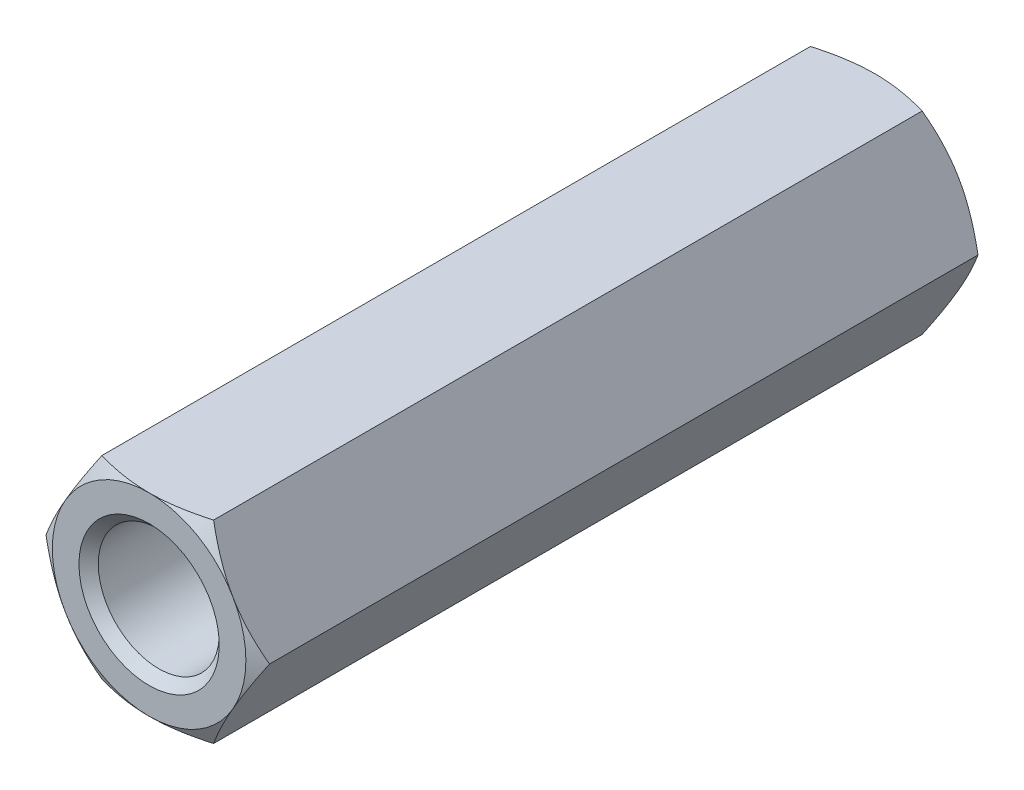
ISO-10303-21;
HEADER;
FILE_DESCRIPTION(('STEP AP214'),'2;1');
FILE_NAME('part.step','',(''),(''),'','','');
FILE_SCHEMA(('AUTOMOTIVE_DESIGN { 1 0 10303 214 1 1 1 1 }'));
ENDSEC;
DATA;
#1=APPLICATION_CONTEXT('core data for automotive mechanical design processes');
#2=APPLICATION_PROTOCOL_DEFINITION('international standard','automotive_design',2000,#1);
#3=PRODUCT_CONTEXT('',#1,'mechanical');
#4=PRODUCT('Part','Part','',(#3));
#5=PRODUCT_RELATED_PRODUCT_CATEGORY('part','',(#4));
#6=PRODUCT_DEFINITION_FORMATION('','',#4);
#7=PRODUCT_DEFINITION_CONTEXT('part definition',#1,'design');
#8=PRODUCT_DEFINITION('design','',#6,#7);
#9=PRODUCT_DEFINITION_SHAPE('','',#8);
#10=(LENGTH_UNIT() NAMED_UNIT(*) SI_UNIT(.MILLI.,.METRE.));
#11=(NAMED_UNIT(*) PLANE_ANGLE_UNIT() SI_UNIT($,.RADIAN.));
#12=(NAMED_UNIT(*) SI_UNIT($,.STERADIAN.) SOLID_ANGLE_UNIT());
#13=UNCERTAINTY_MEASURE_WITH_UNIT(LENGTH_MEASURE(1.E-05),#10,'distance_accuracy_value','');
#14=(GEOMETRIC_REPRESENTATION_CONTEXT(3) GLOBAL_UNCERTAINTY_ASSIGNED_CONTEXT((#13)) GLOBAL_UNIT_ASSIGNED_CONTEXT((#10,
#11,#12)) REPRESENTATION_CONTEXT('',''));
#15=CARTESIAN_POINT('',(0.,0.,0.));
#16=DIRECTION('',(0.,0.,1.));
#17=DIRECTION('',(1.,0.,0.));
#18=AXIS2_PLACEMENT_3D('',#15,#16,#17);
#19=CARTESIAN_POINT('',(4.61880215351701,0.,-15.));
#20=DIRECTION('',(0.866025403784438,0.5,0.));
#21=DIRECTION('',(-0.5,0.866025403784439,0.));
#22=AXIS2_PLACEMENT_3D('',#19,#20,#21);
#23=PLANE('',#22);
#24=CARTESIAN_POINT('',(4.61891762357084,-0.000199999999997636,14.6426677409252));
#25=CARTESIAN_POINT('',(4.5174314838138,0.17557915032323,14.7012821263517));
#26=CARTESIAN_POINT('',(4.41506932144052,0.352875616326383,14.7545896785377));
#27=CARTESIAN_POINT('',(4.20857250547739,0.710538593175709,14.8476383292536));
#28=CARTESIAN_POINT('',(4.10443418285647,0.890911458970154,14.8873465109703));
#29=CARTESIAN_POINT('',(3.89744813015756,1.24942181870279,14.9491577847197));
#30=CARTESIAN_POINT('',(3.79463224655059,1.42750415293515,14.9716722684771));
#31=CARTESIAN_POINT('',(3.58851671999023,1.78450671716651,14.9985493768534));
#32=CARTESIAN_POINT('',(3.48521782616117,1.9634256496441,15.0029342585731));
#33=CARTESIAN_POINT('',(3.29219970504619,2.29774284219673,14.99380992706));
#34=CARTESIAN_POINT('',(3.20245157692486,2.45319115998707,14.982541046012));
#35=CARTESIAN_POINT('',(3.02354002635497,2.76307505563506,14.9468260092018));
#36=CARTESIAN_POINT('',(2.93437722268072,2.91750956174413,14.9223676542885));
#37=CARTESIAN_POINT('',(2.75509682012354,3.22803232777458,14.8612239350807));
#38=CARTESIAN_POINT('',(2.6650019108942,3.3840812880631,14.8242793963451));
#39=CARTESIAN_POINT('',(2.48615580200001,3.69385183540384,14.740429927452));
#40=CARTESIAN_POINT('',(2.39740231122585,3.84757739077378,14.6935446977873));
#41=CARTESIAN_POINT('',(2.30928560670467,4.0002,14.6426677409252));
#42=B_SPLINE_CURVE_WITH_KNOTS('',3,(#24,#25,#26,#27,#28,#29,#30,#31,#32,#33,#34,#35,#36,#37,#38,
#39,#40,#41),.UNSPECIFIED.,.F.,.F.,(4,2,2,2,2,2,2,2,4),(0.,0.634047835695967,1.26961969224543,
1.88946157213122,2.50854226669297,3.04757825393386,3.58711366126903,4.13861653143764,
4.68903648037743),.UNSPECIFIED.);
#43=CARTESIAN_POINT('',(4.61880215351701,0.,14.6427344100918));
#44=VERTEX_POINT('',#43);
#45=CARTESIAN_POINT('',(3.46410161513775,2.,15.));
#46=VERTEX_POINT('',#45);
#47=EDGE_CURVE('E171',#44,#46,#42,.T.);
#48=ORIENTED_EDGE('',*,*,#47,.F.);
#49=DIRECTION('',(0.,0.,1.));
#50=VECTOR('',#49,1.);
#51=CARTESIAN_POINT('',(4.61880215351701,0.,-15.));
#52=LINE('',#51,#50);
#53=CARTESIAN_POINT('',(4.61880215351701,0.,-14.6427344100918));
#54=VERTEX_POINT('',#53);
#55=EDGE_CURVE('E320',#54,#44,#52,.T.);
#56=ORIENTED_EDGE('',*,*,#55,.F.);
#57=CARTESIAN_POINT('',(4.61891762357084,-0.000199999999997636,-14.6426677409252));
#58=CARTESIAN_POINT('',(4.5174314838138,0.17557915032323,-14.7012821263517));
#59=CARTESIAN_POINT('',(4.41506932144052,0.352875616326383,-14.7545896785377));
#60=CARTESIAN_POINT('',(4.20857250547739,0.710538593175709,-14.8476383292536));
#61=CARTESIAN_POINT('',(4.10443418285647,0.890911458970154,-14.8873465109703));
#62=CARTESIAN_POINT('',(3.89744813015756,1.24942181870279,-14.9491577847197));
#63=CARTESIAN_POINT('',(3.79463224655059,1.42750415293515,-14.9716722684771));
#64=CARTESIAN_POINT('',(3.58851671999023,1.78450671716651,-14.9985493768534));
#65=CARTESIAN_POINT('',(3.48521782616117,1.9634256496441,-15.0029342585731));
#66=CARTESIAN_POINT('',(3.29219970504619,2.29774284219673,-14.99380992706));
#67=CARTESIAN_POINT('',(3.20245157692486,2.45319115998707,-14.982541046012));
#68=CARTESIAN_POINT('',(3.02354002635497,2.76307505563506,-14.9468260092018));
#69=CARTESIAN_POINT('',(2.93437722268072,2.91750956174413,-14.9223676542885));
#70=CARTESIAN_POINT('',(2.75509682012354,3.22803232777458,-14.8612239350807));
#71=CARTESIAN_POINT('',(2.6650019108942,3.3840812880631,-14.8242793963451));
#72=CARTESIAN_POINT('',(2.48615580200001,3.69385183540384,-14.740429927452));
#73=CARTESIAN_POINT('',(2.39740231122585,3.84757739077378,-14.6935446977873));
#74=CARTESIAN_POINT('',(2.30928560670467,4.0002,-14.6426677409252));
#75=B_SPLINE_CURVE_WITH_KNOTS('',3,(#57,#58,#59,#60,#61,#62,#63,#64,#65,#66,#67,#68,#69,#70,#71,
#72,#73,#74),.UNSPECIFIED.,.F.,.F.,(4,2,2,2,2,2,2,2,4),(0.,0.634047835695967,1.26961969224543,
1.88946157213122,2.50854226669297,3.04757825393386,3.58711366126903,4.13861653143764,
4.68903648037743),.UNSPECIFIED.);
#76=CARTESIAN_POINT('',(3.46410161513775,2.,-15.));
#77=VERTEX_POINT('',#76);
#78=EDGE_CURVE('E305',#54,#77,#75,.T.);
#79=ORIENTED_EDGE('',*,*,#78,.T.);
#80=CARTESIAN_POINT('',(2.30940107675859,4.,-14.6427344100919));
#81=VERTEX_POINT('',#80);
#82=EDGE_CURVE('E252',#77,#81,#75,.T.);
#83=ORIENTED_EDGE('',*,*,#82,.T.);
#84=DIRECTION('',(0.,0.,1.));
#85=VECTOR('',#84,1.);
#86=CARTESIAN_POINT('',(2.3094010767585,4.,-15.));
#87=LINE('',#86,#85);
#88=CARTESIAN_POINT('',(2.30940107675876,4.,14.642734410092));
#89=VERTEX_POINT('',#88);
#90=EDGE_CURVE('E353',#81,#89,#87,.T.);
#91=ORIENTED_EDGE('',*,*,#90,.T.);
#92=EDGE_CURVE('E147',#46,#89,#42,.T.);
#93=ORIENTED_EDGE('',*,*,#92,.F.);
#94=EDGE_LOOP('',(#48,#56,#79,#83,#91,#93));
#95=FACE_BOUND('',#94,.T.);
#96=ADVANCED_FACE('F41',(#95),#23,.T.);
#97=CARTESIAN_POINT('',(2.3094010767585,-4.,-15.));
#98=DIRECTION('',(0.866025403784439,-0.5,0.));
#99=DIRECTION('',(0.5,0.866025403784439,0.));
#100=AXIS2_PLACEMENT_3D('',#97,#98,#99);
#101=PLANE('',#100);
#102=CARTESIAN_POINT('',(2.30928560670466,-4.0002,14.6426677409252));
#103=CARTESIAN_POINT('',(2.4107717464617,-3.82442084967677,14.7012821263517));
#104=CARTESIAN_POINT('',(2.51313390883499,-3.64712438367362,14.7545896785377));
#105=CARTESIAN_POINT('',(2.71963072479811,-3.28946140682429,14.8476383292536));
#106=CARTESIAN_POINT('',(2.82376904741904,-3.10908854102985,14.8873465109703));
#107=CARTESIAN_POINT('',(3.03075510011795,-2.75057818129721,14.9491577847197));
#108=CARTESIAN_POINT('',(3.13357098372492,-2.57249584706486,14.9716722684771));
#109=CARTESIAN_POINT('',(3.33968651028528,-2.21549328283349,14.9985493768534));
#110=CARTESIAN_POINT('',(3.44298540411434,-2.0365743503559,15.0029342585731));
#111=CARTESIAN_POINT('',(3.63600352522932,-1.70225715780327,14.99380992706));
#112=CARTESIAN_POINT('',(3.72575165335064,-1.54680884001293,14.982541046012));
#113=CARTESIAN_POINT('',(3.90466320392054,-1.23692494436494,14.9468260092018));
#114=CARTESIAN_POINT('',(3.99382600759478,-1.08249043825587,14.9223676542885));
#115=CARTESIAN_POINT('',(4.17310641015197,-0.77196767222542,14.8612239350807));
#116=CARTESIAN_POINT('',(4.26320131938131,-0.615918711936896,14.8242793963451));
#117=CARTESIAN_POINT('',(4.4420474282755,-0.306148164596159,14.740429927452));
#118=CARTESIAN_POINT('',(4.53080091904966,-0.152422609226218,14.6935446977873));
#119=CARTESIAN_POINT('',(4.61891762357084,0.00020000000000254,14.6426677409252));
#120=B_SPLINE_CURVE_WITH_KNOTS('',3,(#102,#103,#104,#105,#106,#107,#108,#109,#110,#111,#112,
#113,#114,#115,#116,#117,#118,#119),.UNSPECIFIED.,.F.,.F.,(4,2,2,2,2,2,2,2,4),(0.,
0.634047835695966,1.26961969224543,1.88946157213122,2.50854226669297,3.04757825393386,
3.58711366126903,4.13861653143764,4.68903648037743),.UNSPECIFIED.);
#121=CARTESIAN_POINT('',(2.3094010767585,-4.,14.6427344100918));
#122=VERTEX_POINT('',#121);
#123=CARTESIAN_POINT('',(3.46410161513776,-2.,15.));
#124=VERTEX_POINT('',#123);
#125=EDGE_CURVE('E393',#122,#124,#120,.T.);
#126=ORIENTED_EDGE('',*,*,#125,.F.);
#127=DIRECTION('',(0.,0.,1.));
#128=VECTOR('',#127,1.);
#129=CARTESIAN_POINT('',(2.3094010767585,-4.,-15.));
#130=LINE('',#129,#128);
#131=CARTESIAN_POINT('',(2.3094010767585,-4.,-14.6427344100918));
#132=VERTEX_POINT('',#131);
#133=EDGE_CURVE('E406',#132,#122,#130,.T.);
#134=ORIENTED_EDGE('',*,*,#133,.F.);
#135=CARTESIAN_POINT('',(2.30928560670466,-4.0002,-14.6426677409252));
#136=CARTESIAN_POINT('',(2.4107717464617,-3.82442084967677,-14.7012821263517));
#137=CARTESIAN_POINT('',(2.51313390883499,-3.64712438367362,-14.7545896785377));
#138=CARTESIAN_POINT('',(2.71963072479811,-3.28946140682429,-14.8476383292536));
#139=CARTESIAN_POINT('',(2.82376904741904,-3.10908854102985,-14.8873465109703));
#140=CARTESIAN_POINT('',(3.03075510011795,-2.75057818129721,-14.9491577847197));
#141=CARTESIAN_POINT('',(3.13357098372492,-2.57249584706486,-14.9716722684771));
#142=CARTESIAN_POINT('',(3.33968651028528,-2.21549328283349,-14.9985493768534));
#143=CARTESIAN_POINT('',(3.44298540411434,-2.0365743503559,-15.0029342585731));
#144=CARTESIAN_POINT('',(3.63600352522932,-1.70225715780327,-14.99380992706));
#145=CARTESIAN_POINT('',(3.72575165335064,-1.54680884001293,-14.982541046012));
#146=CARTESIAN_POINT('',(3.90466320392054,-1.23692494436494,-14.9468260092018));
#147=CARTESIAN_POINT('',(3.99382600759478,-1.08249043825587,-14.9223676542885));
#148=CARTESIAN_POINT('',(4.17310641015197,-0.77196767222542,-14.8612239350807));
#149=CARTESIAN_POINT('',(4.26320131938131,-0.615918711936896,-14.8242793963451));
#150=CARTESIAN_POINT('',(4.4420474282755,-0.306148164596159,-14.740429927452));
#151=CARTESIAN_POINT('',(4.53080091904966,-0.152422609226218,-14.6935446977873));
#152=CARTESIAN_POINT('',(4.61891762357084,0.00020000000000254,-14.6426677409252));
#153=B_SPLINE_CURVE_WITH_KNOTS('',3,(#135,#136,#137,#138,#139,#140,#141,#142,#143,#144,#145,
#146,#147,#148,#149,#150,#151,#152),.UNSPECIFIED.,.F.,.F.,(4,2,2,2,2,2,2,2,4),(0.,
0.634047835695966,1.26961969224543,1.88946157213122,2.50854226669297,3.04757825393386,
3.58711366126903,4.13861653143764,4.68903648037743),.UNSPECIFIED.);
#154=CARTESIAN_POINT('',(3.46410161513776,-2.,-15.));
#155=VERTEX_POINT('',#154);
#156=EDGE_CURVE('E335',#132,#155,#153,.T.);
#157=ORIENTED_EDGE('',*,*,#156,.T.);
#158=EDGE_CURVE('E249',#155,#54,#153,.T.);
#159=ORIENTED_EDGE('',*,*,#158,.T.);
#160=ORIENTED_EDGE('',*,*,#55,.T.);
#161=EDGE_CURVE('E175',#124,#44,#120,.T.);
#162=ORIENTED_EDGE('',*,*,#161,.F.);
#163=EDGE_LOOP('',(#126,#134,#157,#159,#160,#162));
#164=FACE_BOUND('',#163,.T.);
#165=ADVANCED_FACE('F332',(#164),#101,.T.);
#166=CARTESIAN_POINT('',(-2.3094010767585,-4.,-15.));
#167=DIRECTION('',(0.,-1.,0.));
#168=DIRECTION('',(0.,0.,-1.));
#169=AXIS2_PLACEMENT_3D('',#166,#167,#168);
#170=PLANE('',#169);
#171=CARTESIAN_POINT('',(-24.529910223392,-4.,2.95999347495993));
#172=CARTESIAN_POINT('',(-24.0041569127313,-4.,3.2595744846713));
#173=CARTESIAN_POINT('',(-23.4783010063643,-4.,3.55897565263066));
#174=CARTESIAN_POINT('',(-22.4263269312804,-4.,4.1573181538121));
#175=CARTESIAN_POINT('',(-21.9002087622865,-4.,4.4562594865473));
#176=CARTESIAN_POINT('',(-20.847613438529,-4.,5.05360466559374));
#177=CARTESIAN_POINT('',(-20.3211362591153,-4.,5.35200846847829));
#178=CARTESIAN_POINT('',(-19.2677841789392,-4.,5.94811289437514));
#179=CARTESIAN_POINT('',(-18.7409092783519,-4.,6.2458135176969));
#180=CARTESIAN_POINT('',(-17.6880402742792,-4.,6.83953895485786));
#181=CARTESIAN_POINT('',(-17.1620474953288,-4.,7.13556611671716));
#182=CARTESIAN_POINT('',(-16.1094130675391,-4.,7.72646430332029));
#183=CARTESIAN_POINT('',(-15.5827714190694,-4.,8.02133532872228));
#184=CARTESIAN_POINT('',(-14.528656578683,-4.,8.60952553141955));
#185=CARTESIAN_POINT('',(-14.0011834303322,-4.,8.90284478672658));
#186=CARTESIAN_POINT('',(-12.9450711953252,-4.,9.48737519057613));
#187=CARTESIAN_POINT('',(-12.416432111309,-4.,9.77858634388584));
#188=CARTESIAN_POINT('',(-11.3530989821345,-4.,10.3604528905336));
#189=CARTESIAN_POINT('',(-10.8183912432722,-4.,10.6510833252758));
#190=CARTESIAN_POINT('',(-10.0144703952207,-4.,11.0836402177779));
#191=CARTESIAN_POINT('',(-9.74617315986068,-4.,11.2272683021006));
#192=CARTESIAN_POINT('',(-9.2088200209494,-4.,11.5130972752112));
#193=CARTESIAN_POINT('',(-8.93976412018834,-4.,11.6552981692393));
#194=CARTESIAN_POINT('',(-8.40003712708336,-4.,11.9382495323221));
#195=CARTESIAN_POINT('',(-8.12936368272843,-4.,12.0789955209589));
#196=CARTESIAN_POINT('',(-7.58681848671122,-4.,12.3581502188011));
#197=CARTESIAN_POINT('',(-7.31494675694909,-4.,12.4965589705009));
#198=CARTESIAN_POINT('',(-6.76970207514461,-4.,12.7702855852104));
#199=CARTESIAN_POINT('',(-6.49632937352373,-4.,12.9056039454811));
#200=CARTESIAN_POINT('',(-5.94757923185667,-4.,13.1721041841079));
#201=CARTESIAN_POINT('',(-5.67220184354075,-4.,13.3032861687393));
#202=CARTESIAN_POINT('',(-5.10777623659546,-4.,13.5650778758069));
#203=CARTESIAN_POINT('',(-4.81862005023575,-4.,13.6954571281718));
#204=CARTESIAN_POINT('',(-4.38201817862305,-4.,13.8843518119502));
#205=CARTESIAN_POINT('',(-4.23601546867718,-4.,13.9462006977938));
#206=CARTESIAN_POINT('',(-3.94289295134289,-4.,14.0671859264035));
#207=CARTESIAN_POINT('',(-3.79577318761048,-4.,14.1263223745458));
#208=CARTESIAN_POINT('',(-3.50054825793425,-4.,14.2411784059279));
#209=CARTESIAN_POINT('',(-3.35244573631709,-4.,14.2969047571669));
#210=CARTESIAN_POINT('',(-3.05479485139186,-4.,14.4043322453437));
#211=CARTESIAN_POINT('',(-2.90524660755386,-4.,14.4560337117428));
#212=CARTESIAN_POINT('',(-2.6045619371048,-4.,14.5545010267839));
#213=CARTESIAN_POINT('',(-2.45342593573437,-4.,14.6012681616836));
#214=CARTESIAN_POINT('',(-2.14944153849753,-4.,14.6887946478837));
#215=CARTESIAN_POINT('',(-1.99659333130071,-4.,14.7295546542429));
#216=CARTESIAN_POINT('',(-1.62479121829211,-4.,14.8193669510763));
#217=CARTESIAN_POINT('',(-1.40491524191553,-4.,14.864762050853));
#218=CARTESIAN_POINT('',(-1.07290957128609,-4.,14.9191532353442));
#219=CARTESIAN_POINT('',(-0.961882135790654,-4.,14.9349995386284));
#220=CARTESIAN_POINT('',(-0.73923703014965,-4.,14.9617336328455));
#221=CARTESIAN_POINT('',(-0.627619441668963,-4.,14.9726220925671));
#222=CARTESIAN_POINT('',(-0.404512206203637,-4.,14.9890960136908));
#223=CARTESIAN_POINT('',(-0.2930243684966,-4.,14.9947058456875));
#224=CARTESIAN_POINT('',(-0.0699080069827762,-4.,15.0005435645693));
#225=CARTESIAN_POINT('',(0.041720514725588,-4.,15.0007715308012));
#226=CARTESIAN_POINT('',(0.264868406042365,-4.,14.9958378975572));
#227=CARTESIAN_POINT('',(0.37638776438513,-4.,14.9906757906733));
#228=CARTESIAN_POINT('',(0.599062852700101,-4.,14.975116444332));
#229=CARTESIAN_POINT('',(0.710218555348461,-4.,14.9647188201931));
#230=CARTESIAN_POINT('',(0.973491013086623,-4.,14.93415287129));
#231=CARTESIAN_POINT('',(1.12535470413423,-4.,14.9117835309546));
#232=CARTESIAN_POINT('',(1.42761451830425,-4.,14.8587319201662));
#233=CARTESIAN_POINT('',(1.57801039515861,-4.,14.8280482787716));
#234=CARTESIAN_POINT('',(2.02698264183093,-4.,14.7252856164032));
#235=CARTESIAN_POINT('',(2.32312708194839,-4.,14.6425232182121));
#236=CARTESIAN_POINT('',(2.76425639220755,-4.,14.5031113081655));
#237=CARTESIAN_POINT('',(2.91167870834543,-4.,14.4537454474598));
#238=CARTESIAN_POINT('',(3.20508025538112,-4.,14.3508574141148));
#239=CARTESIAN_POINT('',(3.35105948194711,-4.,14.2973352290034));
#240=CARTESIAN_POINT('',(3.64164162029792,-4.,14.1869235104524));
#241=CARTESIAN_POINT('',(3.78624519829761,-4.,14.1300357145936));
#242=CARTESIAN_POINT('',(4.07431555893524,-4.,14.0134693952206));
#243=CARTESIAN_POINT('',(4.21778237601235,-4.,13.9537909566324));
#244=CARTESIAN_POINT('',(4.52495721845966,-4.,13.8230990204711));
#245=CARTESIAN_POINT('',(4.68850848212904,-4.,13.7517179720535));
#246=CARTESIAN_POINT('',(5.01451463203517,-4.,13.6064905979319));
#247=CARTESIAN_POINT('',(5.17696948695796,-4.,13.5326442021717));
#248=CARTESIAN_POINT('',(5.6629854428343,-4.,13.3080909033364));
#249=CARTESIAN_POINT('',(5.98516058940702,-4.,13.1543860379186));
#250=CARTESIAN_POINT('',(6.62697401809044,-4.,12.8414634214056));
#251=CARTESIAN_POINT('',(6.94661114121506,-4.,12.6822433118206));
#252=CARTESIAN_POINT('',(7.58392313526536,-4.,12.3599131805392));
#253=CARTESIAN_POINT('',(7.90159796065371,-4.,12.1968030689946));
#254=CARTESIAN_POINT('',(8.53587250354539,-4.,11.8675302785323));
#255=CARTESIAN_POINT('',(8.85247033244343,-4.,11.7013639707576));
#256=CARTESIAN_POINT('',(9.48453494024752,-4.,11.3668860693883));
#257=CARTESIAN_POINT('',(9.80000170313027,-4.,11.1985744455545));
#258=CARTESIAN_POINT('',(10.4299634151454,-4.,10.8603512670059));
#259=CARTESIAN_POINT('',(10.7444586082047,-4.,10.6904401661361));
#260=CARTESIAN_POINT('',(11.3727470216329,-4.,10.3493244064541));
#261=CARTESIAN_POINT('',(11.6865402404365,-4.,10.1781197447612));
#262=CARTESIAN_POINT('',(12.6238401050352,-4.,9.66474807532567));
#263=CARTESIAN_POINT('',(13.2465187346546,-4.,9.32106972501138));
#264=CARTESIAN_POINT('',(14.4904313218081,-4.,8.63101511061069));
#265=CARTESIAN_POINT('',(15.1116651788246,-4.,8.28463866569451));
#266=CARTESIAN_POINT('',(16.3526897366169,-4.,7.59022553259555));
#267=CARTESIAN_POINT('',(16.9724811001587,-4.,7.24219002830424));
#268=CARTESIAN_POINT('',(18.2112873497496,-4.,6.54476501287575));
#269=CARTESIAN_POINT('',(18.8303022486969,-4.,6.19537552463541));
#270=CARTESIAN_POINT('',(19.8724871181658,-4.,5.60600403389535));
#271=CARTESIAN_POINT('',(20.2958104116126,-4.,5.36629303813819));
#272=CARTESIAN_POINT('',(21.1422831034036,-4.,4.88644258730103));
#273=CARTESIAN_POINT('',(21.5654324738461,-4.,4.64630308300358));
#274=CARTESIAN_POINT('',(22.4122560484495,-4.,4.16528375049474));
#275=CARTESIAN_POINT('',(22.8359299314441,-4.,3.9244033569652));
#276=CARTESIAN_POINT('',(23.6830618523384,-4.,3.44238604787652));
#277=CARTESIAN_POINT('',(24.1065199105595,-4.,3.20124916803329));
#278=CARTESIAN_POINT('',(24.529910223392,-4.,2.95999347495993));
#279=B_SPLINE_CURVE_WITH_KNOTS('',3,(#171,#172,#173,#174,#175,#176,#177,#178,#179,#180,#181,
#182,#183,#184,#185,#186,#187,#188,#189,#190,#191,#192,#193,#194,#195,#196,#197,#198,#199,#200,
#201,#202,#203,#204,#205,#206,#207,#208,#209,#210,#211,#212,#213,#214,#215,#216,#217,#218,#219,
#220,#221,#222,#223,#224,#225,#226,#227,#228,#229,#230,#231,#232,#233,#234,#235,#236,#237,#238,
#239,#240,#241,#242,#243,#244,#245,#246,#247,#248,#249,#250,#251,#252,#253,#254,#255,#256,#257,
#258,#259,#260,#261,#262,#263,#264,#265,#266,#267,#268,#269,#270,#271,#272,#273,#274,#275,#276,
#277,#278),.UNSPECIFIED.,.F.,.F.,(4,2,2,2,2,2,2,2,2,2,2,2,2,2,2,2,2,2,2,2,2,2,2,2,2,2,2,2,2,2,2,
2,2,2,2,2,2,2,2,2,2,2,2,2,2,2,2,2,2,2,2,2,2,4),(0.,1.81534799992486,3.63069792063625,
5.44618845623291,7.26167819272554,9.07239637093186,10.8831135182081,12.6937387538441,
14.5043598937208,16.3301044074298,17.2430698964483,18.1560320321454,19.0712620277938,
19.9864753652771,20.9015403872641,21.8165818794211,22.7680334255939,23.2436999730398,
23.7193480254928,24.1940192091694,24.6686514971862,25.1431597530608,25.6176162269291,
26.2904252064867,26.6267912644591,26.9631119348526,27.297872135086,27.632627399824,
27.9674141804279,28.3022255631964,28.7624504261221,29.2227512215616,30.1440050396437,
30.6103844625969,31.0767652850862,31.5429073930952,32.0090353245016,32.544358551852,
33.0796970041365,34.1504959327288,35.2217585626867,36.2930459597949,37.3657000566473,
38.4383692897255,39.5107428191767,40.5831187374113,42.716787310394,44.8506001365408,
46.9830681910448,49.1155003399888,50.574943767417,52.034567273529,53.4966568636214,
54.9585642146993),.UNSPECIFIED.);
#280=CARTESIAN_POINT('',(-2.3094010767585,-4.,14.6427344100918));
#281=VERTEX_POINT('',#280);
#282=CARTESIAN_POINT('',(0.,-4.,15.));
#283=VERTEX_POINT('',#282);
#284=EDGE_CURVE('E389',#281,#283,#279,.T.);
#285=ORIENTED_EDGE('',*,*,#284,.F.);
#286=DIRECTION('',(0.,0.,1.));
#287=VECTOR('',#286,1.);
#288=CARTESIAN_POINT('',(-2.3094010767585,-4.,-15.));
#289=LINE('',#288,#287);
#290=CARTESIAN_POINT('',(-2.3094010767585,-4.,-14.6427344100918));
#291=VERTEX_POINT('',#290);
#292=EDGE_CURVE('E405',#291,#281,#289,.T.);
#293=ORIENTED_EDGE('',*,*,#292,.F.);
#294=CARTESIAN_POINT('',(-14.5408129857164,-4.,-8.60240690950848));
#295=CARTESIAN_POINT('',(-14.221593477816,-4.,-8.78009811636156));
#296=CARTESIAN_POINT('',(-13.9022061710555,-4.,-8.95748882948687));
#297=CARTESIAN_POINT('',(-13.2630046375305,-4.,-9.31150518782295));
#298=CARTESIAN_POINT('',(-12.9431904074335,-4.,-9.48813082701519));
#299=CARTESIAN_POINT('',(-12.3029388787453,-4.,-9.84051061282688));
#300=CARTESIAN_POINT('',(-11.9825014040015,-4.,-10.0162644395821));
#301=CARTESIAN_POINT('',(-11.3409905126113,-4.,-10.3666057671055));
#302=CARTESIAN_POINT('',(-11.0199170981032,-4.,-10.5411932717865));
#303=CARTESIAN_POINT('',(-10.3751080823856,-4.,-10.8898986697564));
#304=CARTESIAN_POINT('',(-10.0513678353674,-4.,-11.0640079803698));
#305=CARTESIAN_POINT('',(-9.40285488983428,-4.,-11.4102922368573));
#306=CARTESIAN_POINT('',(-9.07808219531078,-4.,-11.582467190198));
#307=CARTESIAN_POINT('',(-8.42724361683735,-4.,-11.9242329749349));
#308=CARTESIAN_POINT('',(-8.10117794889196,-4.,-12.0938242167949));
#309=CARTESIAN_POINT('',(-7.44726728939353,-4.,-12.4295309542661));
#310=CARTESIAN_POINT('',(-7.11942233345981,-4.,-12.5956465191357));
#311=CARTESIAN_POINT('',(-6.46063666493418,-4.,-12.9233753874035));
#312=CARTESIAN_POINT('',(-6.12969099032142,-4.,-13.0849787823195));
#313=CARTESIAN_POINT('',(-5.63070639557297,-4.,-13.3220870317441));
#314=CARTESIAN_POINT('',(-5.46393081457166,-4.,-13.4002491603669));
#315=CARTESIAN_POINT('',(-5.12937560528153,-4.,-13.5543909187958));
#316=CARTESIAN_POINT('',(-4.96159599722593,-4.,-13.630370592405));
#317=CARTESIAN_POINT('',(-4.62450038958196,-4.,-13.7797968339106));
#318=CARTESIAN_POINT('',(-4.45518195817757,-4.,-13.853237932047));
#319=CARTESIAN_POINT('',(-4.11512999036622,-4.,-13.9967571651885));
#320=CARTESIAN_POINT('',(-3.94439652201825,-4.,-14.066835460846));
#321=CARTESIAN_POINT('',(-3.60127780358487,-4.,-14.2027619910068));
#322=CARTESIAN_POINT('',(-3.42889284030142,-4.,-14.2686109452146));
#323=CARTESIAN_POINT('',(-3.08218393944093,-4.,-14.3949660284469));
#324=CARTESIAN_POINT('',(-2.90786018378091,-4.,-14.455472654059));
#325=CARTESIAN_POINT('',(-2.5066039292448,-4.,-14.5861540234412));
#326=CARTESIAN_POINT('',(-2.27893917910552,-4.,-14.6541156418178));
#327=CARTESIAN_POINT('',(-1.81956523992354,-4.,-14.7750256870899));
#328=CARTESIAN_POINT('',(-1.58785668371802,-4.,-14.8279764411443));
#329=CARTESIAN_POINT('',(-1.23876481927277,-4.,-14.8926169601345));
#330=CARTESIAN_POINT('',(-1.12272702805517,-4.,-14.9116409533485));
#331=CARTESIAN_POINT('',(-0.889906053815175,-4.,-14.9444346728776));
#332=CARTESIAN_POINT('',(-0.773122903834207,-4.,-14.9582046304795));
#333=CARTESIAN_POINT('',(-0.539058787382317,-4.,-14.9800768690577));
#334=CARTESIAN_POINT('',(-0.421777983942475,-4.,-14.9881808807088));
#335=CARTESIAN_POINT('',(-0.186938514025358,-4.,-14.9984678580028));
#336=CARTESIAN_POINT('',(-0.0693798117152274,-4.,-15.000650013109));
#337=CARTESIAN_POINT('',(0.165637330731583,-4.,-14.9990156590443));
#338=CARTESIAN_POINT('',(0.283095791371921,-4.,-14.9952022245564));
#339=CARTESIAN_POINT('',(0.517681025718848,-4.,-14.9817165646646));
#340=CARTESIAN_POINT('',(0.634807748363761,-4.,-14.9720434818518));
#341=CARTESIAN_POINT('',(0.985363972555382,-4.,-14.9346497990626));
#342=CARTESIAN_POINT('',(1.21794190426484,-4.,-14.8985550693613));
#343=CARTESIAN_POINT('',(1.56650459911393,-4.,-14.8300497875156));
#344=CARTESIAN_POINT('',(1.68392411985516,-4.,-14.8044587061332));
#345=CARTESIAN_POINT('',(1.91771897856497,-4.,-14.7490421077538));
#346=CARTESIAN_POINT('',(2.03409471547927,-4.,-14.7192182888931));
#347=CARTESIAN_POINT('',(2.26585169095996,-4.,-14.6558721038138));
#348=CARTESIAN_POINT('',(2.38123271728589,-4.,-14.622348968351));
#349=CARTESIAN_POINT('',(2.61101996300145,-4.,-14.5521109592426));
#350=CARTESIAN_POINT('',(2.72542613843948,-4.,-14.515395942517));
#351=CARTESIAN_POINT('',(3.11834372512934,-4.,-14.3841026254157));
#352=CARTESIAN_POINT('',(3.39458528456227,-4.,-14.2827241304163));
#353=CARTESIAN_POINT('',(3.94273843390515,-4.,-14.0688000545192));
#354=CARTESIAN_POINT('',(4.21464825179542,-4.,-13.9562500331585));
#355=CARTESIAN_POINT('',(4.75543004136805,-4.,-13.7232364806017));
#356=CARTESIAN_POINT('',(5.02429789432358,-4.,-13.6027634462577));
#357=CARTESIAN_POINT('',(5.55942162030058,-4.,-13.3562928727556));
#358=CARTESIAN_POINT('',(5.82567789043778,-4.,-13.2302961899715));
#359=CARTESIAN_POINT('',(6.35739767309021,-4.,-12.9736910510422));
#360=CARTESIAN_POINT('',(6.62285253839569,-4.,-12.8430647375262));
#361=CARTESIAN_POINT('',(7.15224405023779,-4.,-12.5787580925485));
#362=CARTESIAN_POINT('',(7.41618064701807,-4.,-12.4450776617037));
#363=CARTESIAN_POINT('',(7.94267238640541,-4.,-12.1754852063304));
#364=CARTESIAN_POINT('',(8.20522837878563,-4.,-12.0395748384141));
#365=CARTESIAN_POINT('',(8.72939472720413,-4.,-11.7659413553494));
#366=CARTESIAN_POINT('',(8.99100507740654,-4.,-11.6282182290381));
#367=CARTESIAN_POINT('',(9.69765288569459,-4.,-11.2537407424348));
#368=CARTESIAN_POINT('',(10.1419692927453,-4.,-11.0156264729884));
#369=CARTESIAN_POINT('',(11.0291375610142,-4.,-10.5364779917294));
#370=CARTESIAN_POINT('',(11.471989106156,-4.,-10.2954431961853));
#371=CARTESIAN_POINT('',(12.3530231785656,-4.,-9.81323363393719));
#372=CARTESIAN_POINT('',(12.7912147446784,-4.,-9.57207536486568));
#373=CARTESIAN_POINT('',(13.6666416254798,-4.,-9.08825815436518));
#374=CARTESIAN_POINT('',(14.1038771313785,-4.,-8.8455995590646));
#375=CARTESIAN_POINT('',(14.5408129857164,-4.,-8.60240690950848));
#376=B_SPLINE_CURVE_WITH_KNOTS('',3,(#294,#295,#296,#297,#298,#299,#300,#301,#302,#303,#304,
#305,#306,#307,#308,#309,#310,#311,#312,#313,#314,#315,#316,#317,#318,#319,#320,#321,#322,#323,
#324,#325,#326,#327,#328,#329,#330,#331,#332,#333,#334,#335,#336,#337,#338,#339,#340,#341,#342,
#343,#344,#345,#346,#347,#348,#349,#350,#351,#352,#353,#354,#355,#356,#357,#358,#359,#360,#361,
#362,#363,#364,#365,#366,#367,#368,#369,#370,#371,#372,#373,#374,#375),.UNSPECIFIED.,.F.,.F.,(4,
2,2,2,2,2,2,2,2,2,2,2,2,2,2,2,2,2,2,2,2,2,2,2,2,2,2,2,2,2,2,2,2,2,2,2,2,2,2,2,4),(0.,
1.0960285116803,2.1920656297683,3.28847886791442,4.3848884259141,5.48765091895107,
6.59040915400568,7.69299033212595,8.79554951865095,9.90036485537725,10.4529020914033,
11.0054282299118,11.5590788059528,12.1127029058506,12.6662325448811,13.2197106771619,
13.9321254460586,14.6444297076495,14.9970899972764,15.3497347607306,15.7022717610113,
16.0548570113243,16.4072615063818,16.7597175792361,17.4647122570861,17.8251870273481,
18.1855175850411,18.5459232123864,18.9063450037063,19.7886970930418,20.6714013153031,
21.55518430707,22.4388307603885,23.3263664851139,24.2139311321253,25.100863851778,
25.9878020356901,27.5000807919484,29.0126669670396,30.5131707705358,32.0133404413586),.UNSPECIFIED.);
#377=CARTESIAN_POINT('',(0.,-4.,-15.));
#378=VERTEX_POINT('',#377);
#379=EDGE_CURVE('E348',#291,#378,#376,.T.);
#380=ORIENTED_EDGE('',*,*,#379,.T.);
#381=EDGE_CURVE('E277',#378,#132,#376,.T.);
#382=ORIENTED_EDGE('',*,*,#381,.T.);
#383=ORIENTED_EDGE('',*,*,#133,.T.);
#384=EDGE_CURVE('E211',#283,#122,#279,.T.);
#385=ORIENTED_EDGE('',*,*,#384,.F.);
#386=EDGE_LOOP('',(#285,#293,#380,#382,#383,#385));
#387=FACE_BOUND('',#386,.T.);
#388=ADVANCED_FACE('F234',(#387),#170,.T.);
#389=CARTESIAN_POINT('',(-4.61880215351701,0.,-15.));
#390=DIRECTION('',(-0.866025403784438,-0.5,0.));
#391=DIRECTION('',(0.5,-0.866025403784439,0.));
#392=AXIS2_PLACEMENT_3D('',#389,#390,#391);
#393=PLANE('',#392);
#394=CARTESIAN_POINT('',(-4.61891762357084,0.000199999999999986,14.6426677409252));
#395=CARTESIAN_POINT('',(-4.51743148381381,-0.175579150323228,14.7012821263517));
#396=CARTESIAN_POINT('',(-4.41506932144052,-0.352875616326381,14.7545896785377));
#397=CARTESIAN_POINT('',(-4.20857250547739,-0.710538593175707,14.8476383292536));
#398=CARTESIAN_POINT('',(-4.10443418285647,-0.890911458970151,14.8873465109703));
#399=CARTESIAN_POINT('',(-3.89744813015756,-1.24942181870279,14.9491577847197));
#400=CARTESIAN_POINT('',(-3.79463224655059,-1.42750415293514,14.9716722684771));
#401=CARTESIAN_POINT('',(-3.58851671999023,-1.78450671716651,14.9985493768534));
#402=CARTESIAN_POINT('',(-3.48521782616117,-1.9634256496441,15.0029342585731));
#403=CARTESIAN_POINT('',(-3.29219970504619,-2.29774284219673,14.99380992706));
#404=CARTESIAN_POINT('',(-3.20245157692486,-2.45319115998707,14.982541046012));
#405=CARTESIAN_POINT('',(-3.02354002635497,-2.76307505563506,14.9468260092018));
#406=CARTESIAN_POINT('',(-2.93437722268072,-2.91750956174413,14.9223676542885));
#407=CARTESIAN_POINT('',(-2.75509682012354,-3.22803232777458,14.8612239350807));
#408=CARTESIAN_POINT('',(-2.6650019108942,-3.3840812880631,14.8242793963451));
#409=CARTESIAN_POINT('',(-2.48615580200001,-3.69385183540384,14.740429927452));
#410=CARTESIAN_POINT('',(-2.39740231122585,-3.84757739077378,14.6935446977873));
#411=CARTESIAN_POINT('',(-2.30928560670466,-4.0002,14.6426677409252));
#412=B_SPLINE_CURVE_WITH_KNOTS('',3,(#394,#395,#396,#397,#398,#399,#400,#401,#402,#403,#404,
#405,#406,#407,#408,#409,#410,#411),.UNSPECIFIED.,.F.,.F.,(4,2,2,2,2,2,2,2,4),(0.,
0.634047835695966,1.26961969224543,1.88946157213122,2.50854226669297,3.04757825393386,
3.58711366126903,4.13861653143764,4.68903648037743),.UNSPECIFIED.);
#413=CARTESIAN_POINT('',(-4.61880215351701,0.,14.6427344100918));
#414=VERTEX_POINT('',#413);
#415=CARTESIAN_POINT('',(-3.46410161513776,-2.,15.));
#416=VERTEX_POINT('',#415);
#417=EDGE_CURVE('E156',#414,#416,#412,.T.);
#418=ORIENTED_EDGE('',*,*,#417,.F.);
#419=DIRECTION('',(0.,0.,1.));
#420=VECTOR('',#419,1.);
#421=CARTESIAN_POINT('',(-4.61880215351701,0.,-15.));
#422=LINE('',#421,#420);
#423=CARTESIAN_POINT('',(-4.61880215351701,0.,-14.6427344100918));
#424=VERTEX_POINT('',#423);
#425=EDGE_CURVE('E169',#424,#414,#422,.T.);
#426=ORIENTED_EDGE('',*,*,#425,.F.);
#427=CARTESIAN_POINT('',(-4.61891762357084,0.000199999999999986,-14.6426677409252));
#428=CARTESIAN_POINT('',(-4.51743148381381,-0.175579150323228,-14.7012821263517));
#429=CARTESIAN_POINT('',(-4.41506932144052,-0.352875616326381,-14.7545896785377));
#430=CARTESIAN_POINT('',(-4.20857250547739,-0.710538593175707,-14.8476383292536));
#431=CARTESIAN_POINT('',(-4.10443418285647,-0.890911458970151,-14.8873465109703));
#432=CARTESIAN_POINT('',(-3.89744813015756,-1.24942181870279,-14.9491577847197));
#433=CARTESIAN_POINT('',(-3.79463224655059,-1.42750415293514,-14.9716722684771));
#434=CARTESIAN_POINT('',(-3.58851671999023,-1.78450671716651,-14.9985493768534));
#435=CARTESIAN_POINT('',(-3.48521782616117,-1.9634256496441,-15.0029342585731));
#436=CARTESIAN_POINT('',(-3.29219970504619,-2.29774284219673,-14.99380992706));
#437=CARTESIAN_POINT('',(-3.20245157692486,-2.45319115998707,-14.982541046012));
#438=CARTESIAN_POINT('',(-3.02354002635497,-2.76307505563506,-14.9468260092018));
#439=CARTESIAN_POINT('',(-2.93437722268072,-2.91750956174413,-14.9223676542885));
#440=CARTESIAN_POINT('',(-2.75509682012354,-3.22803232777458,-14.8612239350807));
#441=CARTESIAN_POINT('',(-2.6650019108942,-3.3840812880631,-14.8242793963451));
#442=CARTESIAN_POINT('',(-2.48615580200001,-3.69385183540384,-14.740429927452));
#443=CARTESIAN_POINT('',(-2.39740231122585,-3.84757739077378,-14.6935446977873));
#444=CARTESIAN_POINT('',(-2.30928560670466,-4.0002,-14.6426677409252));
#445=B_SPLINE_CURVE_WITH_KNOTS('',3,(#427,#428,#429,#430,#431,#432,#433,#434,#435,#436,#437,
#438,#439,#440,#441,#442,#443,#444),.UNSPECIFIED.,.F.,.F.,(4,2,2,2,2,2,2,2,4),(0.,
0.634047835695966,1.26961969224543,1.88946157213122,2.50854226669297,3.04757825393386,
3.58711366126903,4.13861653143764,4.68903648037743),.UNSPECIFIED.);
#446=CARTESIAN_POINT('',(-3.46410161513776,-2.,-15.));
#447=VERTEX_POINT('',#446);
#448=EDGE_CURVE('E239',#424,#447,#445,.T.);
#449=ORIENTED_EDGE('',*,*,#448,.T.);
#450=EDGE_CURVE('E251',#447,#291,#445,.T.);
#451=ORIENTED_EDGE('',*,*,#450,.T.);
#452=ORIENTED_EDGE('',*,*,#292,.T.);
#453=EDGE_CURVE('E177',#416,#281,#412,.T.);
#454=ORIENTED_EDGE('',*,*,#453,.F.);
#455=EDGE_LOOP('',(#418,#426,#449,#451,#452,#454));
#456=FACE_BOUND('',#455,.T.);
#457=ADVANCED_FACE('F231',(#456),#393,.T.);
#458=CARTESIAN_POINT('',(-2.3094010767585,4.,-15.));
#459=DIRECTION('',(-0.866025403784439,0.5,0.));
#460=DIRECTION('',(-0.5,-0.866025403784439,0.));
#461=AXIS2_PLACEMENT_3D('',#458,#459,#460);
#462=PLANE('',#461);
#463=CARTESIAN_POINT('',(-2.30928560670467,4.0002,14.6426677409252));
#464=CARTESIAN_POINT('',(-2.41077174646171,3.82442084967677,14.7012821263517));
#465=CARTESIAN_POINT('',(-2.51313390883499,3.64712438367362,14.7545896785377));
#466=CARTESIAN_POINT('',(-2.71963072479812,3.28946140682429,14.8476383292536));
#467=CARTESIAN_POINT('',(-2.82376904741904,3.10908854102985,14.8873465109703));
#468=CARTESIAN_POINT('',(-3.03075510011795,2.75057818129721,14.9491577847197));
#469=CARTESIAN_POINT('',(-3.13357098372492,2.57249584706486,14.9716722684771));
#470=CARTESIAN_POINT('',(-3.33968651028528,2.21549328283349,14.9985493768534));
#471=CARTESIAN_POINT('',(-3.44298540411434,2.0365743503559,15.0029342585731));
#472=CARTESIAN_POINT('',(-3.63600352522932,1.70225715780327,14.99380992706));
#473=CARTESIAN_POINT('',(-3.72575165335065,1.54680884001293,14.982541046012));
#474=CARTESIAN_POINT('',(-3.90466320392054,1.23692494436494,14.9468260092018));
#475=CARTESIAN_POINT('',(-3.99382600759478,1.08249043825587,14.9223676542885));
#476=CARTESIAN_POINT('',(-4.17310641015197,0.771967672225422,14.8612239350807));
#477=CARTESIAN_POINT('',(-4.26320131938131,0.615918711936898,14.8242793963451));
#478=CARTESIAN_POINT('',(-4.4420474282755,0.306148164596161,14.740429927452));
#479=CARTESIAN_POINT('',(-4.53080091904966,0.152422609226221,14.6935446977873));
#480=CARTESIAN_POINT('',(-4.61891762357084,-0.000200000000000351,14.6426677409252));
#481=B_SPLINE_CURVE_WITH_KNOTS('',3,(#463,#464,#465,#466,#467,#468,#469,#470,#471,#472,#473,
#474,#475,#476,#477,#478,#479,#480),.UNSPECIFIED.,.F.,.F.,(4,2,2,2,2,2,2,2,4),(0.,
0.634047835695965,1.26961969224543,1.88946157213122,2.50854226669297,3.04757825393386,
3.58711366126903,4.13861653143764,4.68903648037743),.UNSPECIFIED.);
#482=CARTESIAN_POINT('',(-2.3094010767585,4.,14.6427344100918));
#483=VERTEX_POINT('',#482);
#484=CARTESIAN_POINT('',(-3.46410161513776,2.,15.));
#485=VERTEX_POINT('',#484);
#486=EDGE_CURVE('E135',#483,#485,#481,.T.);
#487=ORIENTED_EDGE('',*,*,#486,.F.);
#488=DIRECTION('',(0.,0.,1.));
#489=VECTOR('',#488,1.);
#490=CARTESIAN_POINT('',(-2.3094010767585,4.,-15.));
#491=LINE('',#490,#489);
#492=CARTESIAN_POINT('',(-2.3094010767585,4.,-14.6427344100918));
#493=VERTEX_POINT('',#492);
#494=EDGE_CURVE('E355',#493,#483,#491,.T.);
#495=ORIENTED_EDGE('',*,*,#494,.F.);
#496=CARTESIAN_POINT('',(-2.30928560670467,4.0002,-14.6426677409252));
#497=CARTESIAN_POINT('',(-2.41077174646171,3.82442084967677,-14.7012821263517));
#498=CARTESIAN_POINT('',(-2.51313390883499,3.64712438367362,-14.7545896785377));
#499=CARTESIAN_POINT('',(-2.71963072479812,3.28946140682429,-14.8476383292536));
#500=CARTESIAN_POINT('',(-2.82376904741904,3.10908854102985,-14.8873465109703));
#501=CARTESIAN_POINT('',(-3.03075510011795,2.75057818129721,-14.9491577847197));
#502=CARTESIAN_POINT('',(-3.13357098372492,2.57249584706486,-14.9716722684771));
#503=CARTESIAN_POINT('',(-3.33968651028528,2.21549328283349,-14.9985493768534));
#504=CARTESIAN_POINT('',(-3.44298540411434,2.0365743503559,-15.0029342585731));
#505=CARTESIAN_POINT('',(-3.63600352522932,1.70225715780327,-14.99380992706));
#506=CARTESIAN_POINT('',(-3.72575165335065,1.54680884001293,-14.982541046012));
#507=CARTESIAN_POINT('',(-3.90466320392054,1.23692494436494,-14.9468260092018));
#508=CARTESIAN_POINT('',(-3.99382600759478,1.08249043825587,-14.9223676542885));
#509=CARTESIAN_POINT('',(-4.17310641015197,0.771967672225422,-14.8612239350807));
#510=CARTESIAN_POINT('',(-4.26320131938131,0.615918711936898,-14.8242793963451));
#511=CARTESIAN_POINT('',(-4.4420474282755,0.306148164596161,-14.740429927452));
#512=CARTESIAN_POINT('',(-4.53080091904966,0.15242260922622,-14.6935446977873));
#513=CARTESIAN_POINT('',(-4.61891762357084,-0.00019999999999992,-14.6426677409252));
#514=B_SPLINE_CURVE_WITH_KNOTS('',3,(#496,#497,#498,#499,#500,#501,#502,#503,#504,#505,#506,
#507,#508,#509,#510,#511,#512,#513),.UNSPECIFIED.,.F.,.F.,(4,2,2,2,2,2,2,2,4),(0.,
0.634047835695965,1.26961969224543,1.88946157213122,2.50854226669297,3.04757825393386,
3.58711366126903,4.13861653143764,4.68903648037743),.UNSPECIFIED.);
#515=CARTESIAN_POINT('',(-3.46410161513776,2.,-15.));
#516=VERTEX_POINT('',#515);
#517=EDGE_CURVE('E293',#493,#516,#514,.T.);
#518=ORIENTED_EDGE('',*,*,#517,.T.);
#519=EDGE_CURVE('E250',#516,#424,#514,.T.);
#520=ORIENTED_EDGE('',*,*,#519,.T.);
#521=ORIENTED_EDGE('',*,*,#425,.T.);
#522=EDGE_CURVE('E150',#485,#414,#481,.T.);
#523=ORIENTED_EDGE('',*,*,#522,.F.);
#524=EDGE_LOOP('',(#487,#495,#518,#520,#521,#523));
#525=FACE_BOUND('',#524,.T.);
#526=ADVANCED_FACE('F166',(#525),#462,.T.);
#527=CARTESIAN_POINT('',(2.3094010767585,4.,-15.));
#528=DIRECTION('',(0.,1.,0.));
#529=DIRECTION('',(0.,0.,1.));
#530=AXIS2_PLACEMENT_3D('',#527,#528,#529);
#531=PLANE('',#530);
#532=CARTESIAN_POINT('',(24.5299102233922,4.,2.95999347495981));
#533=CARTESIAN_POINT('',(24.0041569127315,4.,3.25957448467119));
#534=CARTESIAN_POINT('',(23.4783010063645,4.,3.55897565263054));
#535=CARTESIAN_POINT('',(22.4263269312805,4.,4.15731815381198));
#536=CARTESIAN_POINT('',(21.9002087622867,4.,4.4562594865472));
#537=CARTESIAN_POINT('',(20.8476134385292,4.,5.05360466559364));
#538=CARTESIAN_POINT('',(20.3211362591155,4.,5.35200846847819));
#539=CARTESIAN_POINT('',(19.2677841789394,4.,5.94811289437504));
#540=CARTESIAN_POINT('',(18.7409092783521,4.,6.2458135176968));
#541=CARTESIAN_POINT('',(17.6880402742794,4.,6.83953895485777));
#542=CARTESIAN_POINT('',(17.162047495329,4.,7.13556611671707));
#543=CARTESIAN_POINT('',(16.1094130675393,4.,7.72646430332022));
#544=CARTESIAN_POINT('',(15.5827714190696,4.,8.02133532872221));
#545=CARTESIAN_POINT('',(14.5286565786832,4.,8.60952553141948));
#546=CARTESIAN_POINT('',(14.0011834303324,4.,8.90284478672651));
#547=CARTESIAN_POINT('',(12.9450711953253,4.,9.48737519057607));
#548=CARTESIAN_POINT('',(12.4164321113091,4.,9.77858634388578));
#549=CARTESIAN_POINT('',(11.3530989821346,4.,10.3604528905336));
#550=CARTESIAN_POINT('',(10.8183912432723,4.,10.6510833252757));
#551=CARTESIAN_POINT('',(10.0144703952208,4.,11.0836402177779));
#552=CARTESIAN_POINT('',(9.74617315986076,4.,11.2272683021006));
#553=CARTESIAN_POINT('',(9.20882002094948,4.,11.5130972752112));
#554=CARTESIAN_POINT('',(8.93976412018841,4.,11.6552981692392));
#555=CARTESIAN_POINT('',(8.40003712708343,4.,11.9382495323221));
#556=CARTESIAN_POINT('',(8.1293636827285,4.,12.0789955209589));
#557=CARTESIAN_POINT('',(7.58681848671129,4.,12.3581502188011));
#558=CARTESIAN_POINT('',(7.31494675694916,4.,12.4965589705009));
#559=CARTESIAN_POINT('',(6.76970207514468,4.,12.7702855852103));
#560=CARTESIAN_POINT('',(6.49632937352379,4.,12.9056039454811));
#561=CARTESIAN_POINT('',(5.94757923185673,4.,13.1721041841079));
#562=CARTESIAN_POINT('',(5.67220184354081,4.,13.3032861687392));
#563=CARTESIAN_POINT('',(5.10777623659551,4.,13.5650778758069));
#564=CARTESIAN_POINT('',(4.8186200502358,4.,13.6954571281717));
#565=CARTESIAN_POINT('',(4.3820181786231,4.,13.8843518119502));
#566=CARTESIAN_POINT('',(4.23601546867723,4.,13.9462006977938));
#567=CARTESIAN_POINT('',(3.94289295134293,4.,14.0671859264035));
#568=CARTESIAN_POINT('',(3.79577318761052,4.,14.1263223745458));
#569=CARTESIAN_POINT('',(3.50054825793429,4.,14.2411784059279));
#570=CARTESIAN_POINT('',(3.35244573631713,4.,14.2969047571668));
#571=CARTESIAN_POINT('',(3.0547948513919,4.,14.4043322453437));
#572=CARTESIAN_POINT('',(2.9052466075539,4.,14.4560337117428));
#573=CARTESIAN_POINT('',(2.60456193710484,4.,14.5545010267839));
#574=CARTESIAN_POINT('',(2.45342593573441,4.,14.6012681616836));
#575=CARTESIAN_POINT('',(2.14944153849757,4.,14.6887946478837));
#576=CARTESIAN_POINT('',(1.99659333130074,4.,14.7295546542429));
#577=CARTESIAN_POINT('',(1.62479121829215,4.,14.8193669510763));
#578=CARTESIAN_POINT('',(1.40491524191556,4.,14.864762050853));
#579=CARTESIAN_POINT('',(1.07290957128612,4.,14.9191532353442));
#580=CARTESIAN_POINT('',(0.961882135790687,4.,14.9349995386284));
#581=CARTESIAN_POINT('',(0.739237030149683,4.,14.9617336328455));
#582=CARTESIAN_POINT('',(0.627619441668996,4.,14.9726220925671));
#583=CARTESIAN_POINT('',(0.404512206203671,4.,14.9890960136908));
#584=CARTESIAN_POINT('',(0.293024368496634,4.,14.9947058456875));
#585=CARTESIAN_POINT('',(0.0699080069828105,4.,15.0005435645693));
#586=CARTESIAN_POINT('',(-0.0417205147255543,4.,15.0007715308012));
#587=CARTESIAN_POINT('',(-0.264868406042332,4.,14.9958378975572));
#588=CARTESIAN_POINT('',(-0.376387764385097,4.,14.9906757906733));
#589=CARTESIAN_POINT('',(-0.59906285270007,4.,14.975116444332));
#590=CARTESIAN_POINT('',(-0.710218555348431,4.,14.9647188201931));
#591=CARTESIAN_POINT('',(-0.973491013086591,4.,14.93415287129));
#592=CARTESIAN_POINT('',(-1.12535470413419,4.,14.9117835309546));
#593=CARTESIAN_POINT('',(-1.42761451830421,4.,14.8587319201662));
#594=CARTESIAN_POINT('',(-1.57801039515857,4.,14.8280482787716));
#595=CARTESIAN_POINT('',(-2.02698264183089,4.,14.7252856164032));
#596=CARTESIAN_POINT('',(-2.32312708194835,4.,14.6425232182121));
#597=CARTESIAN_POINT('',(-2.7642563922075,4.,14.5031113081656));
#598=CARTESIAN_POINT('',(-2.91167870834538,4.,14.4537454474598));
#599=CARTESIAN_POINT('',(-3.20508025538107,4.,14.3508574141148));
#600=CARTESIAN_POINT('',(-3.35105948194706,4.,14.2973352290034));
#601=CARTESIAN_POINT('',(-3.64164162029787,4.,14.1869235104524));
#602=CARTESIAN_POINT('',(-3.78624519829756,4.,14.1300357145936));
#603=CARTESIAN_POINT('',(-4.07431555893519,4.,14.0134693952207));
#604=CARTESIAN_POINT('',(-4.2177823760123,4.,13.9537909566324));
#605=CARTESIAN_POINT('',(-4.5249572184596,4.,13.8230990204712));
#606=CARTESIAN_POINT('',(-4.68850848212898,4.,13.7517179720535));
#607=CARTESIAN_POINT('',(-5.01451463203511,4.,13.606490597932));
#608=CARTESIAN_POINT('',(-5.17696948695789,4.,13.5326442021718));
#609=CARTESIAN_POINT('',(-5.66298544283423,4.,13.3080909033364));
#610=CARTESIAN_POINT('',(-5.98516058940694,4.,13.1543860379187));
#611=CARTESIAN_POINT('',(-6.62697401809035,4.,12.8414634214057));
#612=CARTESIAN_POINT('',(-6.94661114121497,4.,12.6822433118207));
#613=CARTESIAN_POINT('',(-7.58392313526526,4.,12.3599131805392));
#614=CARTESIAN_POINT('',(-7.90159796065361,4.,12.1968030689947));
#615=CARTESIAN_POINT('',(-8.53587250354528,4.,11.8675302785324));
#616=CARTESIAN_POINT('',(-8.85247033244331,4.,11.7013639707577));
#617=CARTESIAN_POINT('',(-9.48453494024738,4.,11.3668860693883));
#618=CARTESIAN_POINT('',(-9.80000170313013,4.,11.1985744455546));
#619=CARTESIAN_POINT('',(-10.4299634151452,4.,10.860351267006));
#620=CARTESIAN_POINT('',(-10.7444586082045,4.,10.6904401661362));
#621=CARTESIAN_POINT('',(-11.3727470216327,4.,10.3493244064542));
#622=CARTESIAN_POINT('',(-11.6865402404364,4.,10.1781197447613));
#623=CARTESIAN_POINT('',(-12.6238401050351,4.,9.66474807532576));
#624=CARTESIAN_POINT('',(-13.2465187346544,4.,9.32106972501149));
#625=CARTESIAN_POINT('',(-14.4904313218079,4.,8.63101511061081));
#626=CARTESIAN_POINT('',(-15.1116651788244,4.,8.28463866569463));
#627=CARTESIAN_POINT('',(-16.3526897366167,4.,7.59022553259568));
#628=CARTESIAN_POINT('',(-16.9724811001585,4.,7.24219002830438));
#629=CARTESIAN_POINT('',(-18.2112873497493,4.,6.5447650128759));
#630=CARTESIAN_POINT('',(-18.8303022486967,4.,6.19537552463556));
#631=CARTESIAN_POINT('',(-19.8724871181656,4.,5.60600403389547));
#632=CARTESIAN_POINT('',(-20.2958104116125,4.,5.36629303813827));
#633=CARTESIAN_POINT('',(-21.1422831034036,4.,4.88644258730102));
#634=CARTESIAN_POINT('',(-21.5654324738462,4.,4.64630308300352));
#635=CARTESIAN_POINT('',(-22.4122560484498,4.,4.16528375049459));
#636=CARTESIAN_POINT('',(-22.8359299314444,4.,3.92440335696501));
#637=CARTESIAN_POINT('',(-23.6830618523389,4.,3.44238604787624));
#638=CARTESIAN_POINT('',(-24.1065199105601,4.,3.20124916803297));
#639=CARTESIAN_POINT('',(-24.5299102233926,4.,2.95999347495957));
#640=B_SPLINE_CURVE_WITH_KNOTS('',3,(#532,#533,#534,#535,#536,#537,#538,#539,#540,#541,#542,
#543,#544,#545,#546,#547,#548,#549,#550,#551,#552,#553,#554,#555,#556,#557,#558,#559,#560,#561,
#562,#563,#564,#565,#566,#567,#568,#569,#570,#571,#572,#573,#574,#575,#576,#577,#578,#579,#580,
#581,#582,#583,#584,#585,#586,#587,#588,#589,#590,#591,#592,#593,#594,#595,#596,#597,#598,#599,
#600,#601,#602,#603,#604,#605,#606,#607,#608,#609,#610,#611,#612,#613,#614,#615,#616,#617,#618,
#619,#620,#621,#622,#623,#624,#625,#626,#627,#628,#629,#630,#631,#632,#633,#634,#635,#636,#637,
#638,#639),.UNSPECIFIED.,.F.,.F.,(4,2,2,2,2,2,2,2,2,2,2,2,2,2,2,2,2,2,2,2,2,2,2,2,2,2,2,2,2,2,2,
2,2,2,2,2,2,2,2,2,2,2,2,2,2,2,2,2,2,2,2,2,2,4),(0.,1.81534799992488,3.63069792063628,
5.44618845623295,7.2616781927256,9.07239637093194,10.8831135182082,12.6937387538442,
14.5043598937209,16.3301044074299,17.2430698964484,18.1560320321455,19.0712620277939,
19.9864753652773,20.9015403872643,21.8165818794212,22.768033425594,23.24369997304,
23.719348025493,24.1940192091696,24.6686514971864,25.143159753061,25.6176162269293,
26.2904252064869,26.6267912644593,26.9631119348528,27.2978721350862,27.6326273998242,
27.9674141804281,28.3022255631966,28.7624504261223,29.2227512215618,30.1440050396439,
30.6103844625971,31.0767652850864,31.5429073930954,32.0090353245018,32.5443585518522,
33.0796970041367,34.1504959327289,35.2217585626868,36.2930459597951,37.3657000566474,
38.4383692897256,39.5107428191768,40.5831187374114,42.7167873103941,44.8506001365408,
46.9830681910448,49.1155003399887,50.5749437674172,52.0345672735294,53.4966568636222,
54.9585642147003),.UNSPECIFIED.);
#641=CARTESIAN_POINT('',(0.,4.,15.));
#642=VERTEX_POINT('',#641);
#643=EDGE_CURVE('E148',#89,#642,#640,.T.);
#644=ORIENTED_EDGE('',*,*,#643,.F.);
#645=ORIENTED_EDGE('',*,*,#90,.F.);
#646=CARTESIAN_POINT('',(14.5408129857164,4.,-8.60240690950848));
#647=CARTESIAN_POINT('',(14.221593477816,4.,-8.78009811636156));
#648=CARTESIAN_POINT('',(13.9022061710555,4.,-8.95748882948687));
#649=CARTESIAN_POINT('',(13.2630046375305,4.,-9.31150518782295));
#650=CARTESIAN_POINT('',(12.9431904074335,4.,-9.48813082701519));
#651=CARTESIAN_POINT('',(12.3029388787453,4.,-9.84051061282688));
#652=CARTESIAN_POINT('',(11.9825014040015,4.,-10.0162644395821));
#653=CARTESIAN_POINT('',(11.3409905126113,4.,-10.3666057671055));
#654=CARTESIAN_POINT('',(11.0199170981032,4.,-10.5411932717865));
#655=CARTESIAN_POINT('',(10.3751080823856,4.,-10.8898986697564));
#656=CARTESIAN_POINT('',(10.0513678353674,4.,-11.0640079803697));
#657=CARTESIAN_POINT('',(9.40285488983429,4.,-11.4102922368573));
#658=CARTESIAN_POINT('',(9.07808219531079,4.,-11.582467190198));
#659=CARTESIAN_POINT('',(8.42724361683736,4.,-11.9242329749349));
#660=CARTESIAN_POINT('',(8.10117794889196,4.,-12.0938242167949));
#661=CARTESIAN_POINT('',(7.44726728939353,4.,-12.4295309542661));
#662=CARTESIAN_POINT('',(7.11942233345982,4.,-12.5956465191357));
#663=CARTESIAN_POINT('',(6.46063666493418,4.,-12.9233753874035));
#664=CARTESIAN_POINT('',(6.12969099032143,4.,-13.0849787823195));
#665=CARTESIAN_POINT('',(5.63070639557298,4.,-13.3220870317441));
#666=CARTESIAN_POINT('',(5.46393081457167,4.,-13.4002491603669));
#667=CARTESIAN_POINT('',(5.12937560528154,4.,-13.5543909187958));
#668=CARTESIAN_POINT('',(4.96159599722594,4.,-13.630370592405));
#669=CARTESIAN_POINT('',(4.62450038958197,4.,-13.7797968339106));
#670=CARTESIAN_POINT('',(4.45518195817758,4.,-13.853237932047));
#671=CARTESIAN_POINT('',(4.11512999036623,4.,-13.9967571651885));
#672=CARTESIAN_POINT('',(3.94439652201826,4.,-14.066835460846));
#673=CARTESIAN_POINT('',(3.60127780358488,4.,-14.2027619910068));
#674=CARTESIAN_POINT('',(3.42889284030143,4.,-14.2686109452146));
#675=CARTESIAN_POINT('',(3.08218393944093,4.,-14.3949660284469));
#676=CARTESIAN_POINT('',(2.90786018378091,4.,-14.455472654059));
#677=CARTESIAN_POINT('',(2.5066039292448,4.,-14.5861540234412));
#678=CARTESIAN_POINT('',(2.27893917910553,4.,-14.6541156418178));
#679=CARTESIAN_POINT('',(1.81956523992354,4.,-14.7750256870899));
#680=CARTESIAN_POINT('',(1.58785668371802,4.,-14.8279764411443));
#681=CARTESIAN_POINT('',(1.23876481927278,4.,-14.8926169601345));
#682=CARTESIAN_POINT('',(1.12272702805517,4.,-14.9116409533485));
#683=CARTESIAN_POINT('',(0.889906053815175,4.,-14.9444346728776));
#684=CARTESIAN_POINT('',(0.773122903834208,4.,-14.9582046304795));
#685=CARTESIAN_POINT('',(0.539058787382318,4.,-14.9800768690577));
#686=CARTESIAN_POINT('',(0.421777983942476,4.,-14.9881808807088));
#687=CARTESIAN_POINT('',(0.186938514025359,4.,-14.9984678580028));
#688=CARTESIAN_POINT('',(0.069379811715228,4.,-15.000650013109));
#689=CARTESIAN_POINT('',(-0.165637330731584,4.,-14.9990156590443));
#690=CARTESIAN_POINT('',(-0.283095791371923,4.,-14.9952022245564));
#691=CARTESIAN_POINT('',(-0.517681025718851,4.,-14.9817165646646));
#692=CARTESIAN_POINT('',(-0.634807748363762,4.,-14.9720434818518));
#693=CARTESIAN_POINT('',(-0.98536397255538,4.,-14.9346497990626));
#694=CARTESIAN_POINT('',(-1.21794190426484,4.,-14.8985550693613));
#695=CARTESIAN_POINT('',(-1.56650459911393,4.,-14.8300497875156));
#696=CARTESIAN_POINT('',(-1.68392411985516,4.,-14.8044587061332));
#697=CARTESIAN_POINT('',(-1.91771897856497,4.,-14.7490421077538));
#698=CARTESIAN_POINT('',(-2.03409471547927,4.,-14.7192182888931));
#699=CARTESIAN_POINT('',(-2.26585169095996,4.,-14.6558721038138));
#700=CARTESIAN_POINT('',(-2.38123271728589,4.,-14.622348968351));
#701=CARTESIAN_POINT('',(-2.61101996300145,4.,-14.5521109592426));
#702=CARTESIAN_POINT('',(-2.72542613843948,4.,-14.515395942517));
#703=CARTESIAN_POINT('',(-3.11834372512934,4.,-14.3841026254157));
#704=CARTESIAN_POINT('',(-3.39458528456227,4.,-14.2827241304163));
#705=CARTESIAN_POINT('',(-3.94273843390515,4.,-14.0688000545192));
#706=CARTESIAN_POINT('',(-4.21464825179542,4.,-13.9562500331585));
#707=CARTESIAN_POINT('',(-4.75543004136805,4.,-13.7232364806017));
#708=CARTESIAN_POINT('',(-5.02429789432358,4.,-13.6027634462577));
#709=CARTESIAN_POINT('',(-5.55942162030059,4.,-13.3562928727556));
#710=CARTESIAN_POINT('',(-5.82567789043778,4.,-13.2302961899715));
#711=CARTESIAN_POINT('',(-6.35739767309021,4.,-12.9736910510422));
#712=CARTESIAN_POINT('',(-6.62285253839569,4.,-12.8430647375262));
#713=CARTESIAN_POINT('',(-7.1522440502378,4.,-12.5787580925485));
#714=CARTESIAN_POINT('',(-7.41618064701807,4.,-12.4450776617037));
#715=CARTESIAN_POINT('',(-7.94267238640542,4.,-12.1754852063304));
#716=CARTESIAN_POINT('',(-8.20522837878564,4.,-12.0395748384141));
#717=CARTESIAN_POINT('',(-8.72939472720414,4.,-11.7659413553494));
#718=CARTESIAN_POINT('',(-8.99100507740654,4.,-11.6282182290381));
#719=CARTESIAN_POINT('',(-9.69765288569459,4.,-11.2537407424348));
#720=CARTESIAN_POINT('',(-10.1419692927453,4.,-11.0156264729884));
#721=CARTESIAN_POINT('',(-11.0291375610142,4.,-10.5364779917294));
#722=CARTESIAN_POINT('',(-11.471989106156,4.,-10.2954431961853));
#723=CARTESIAN_POINT('',(-12.3530231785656,4.,-9.81323363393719));
#724=CARTESIAN_POINT('',(-12.7912147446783,4.,-9.57207536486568));
#725=CARTESIAN_POINT('',(-13.6666416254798,4.,-9.08825815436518));
#726=CARTESIAN_POINT('',(-14.1038771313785,4.,-8.8455995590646));
#727=CARTESIAN_POINT('',(-14.5408129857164,4.,-8.60240690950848));
#728=B_SPLINE_CURVE_WITH_KNOTS('',3,(#646,#647,#648,#649,#650,#651,#652,#653,#654,#655,#656,
#657,#658,#659,#660,#661,#662,#663,#664,#665,#666,#667,#668,#669,#670,#671,#672,#673,#674,#675,
#676,#677,#678,#679,#680,#681,#682,#683,#684,#685,#686,#687,#688,#689,#690,#691,#692,#693,#694,
#695,#696,#697,#698,#699,#700,#701,#702,#703,#704,#705,#706,#707,#708,#709,#710,#711,#712,#713,
#714,#715,#716,#717,#718,#719,#720,#721,#722,#723,#724,#725,#726,#727),.UNSPECIFIED.,.F.,.F.,(4,
2,2,2,2,2,2,2,2,2,2,2,2,2,2,2,2,2,2,2,2,2,2,2,2,2,2,2,2,2,2,2,2,2,2,2,2,2,2,2,4),(0.,
1.0960285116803,2.1920656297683,3.28847886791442,4.3848884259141,5.48765091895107,
6.59040915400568,7.69299033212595,8.79554951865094,9.90036485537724,10.4529020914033,
11.0054282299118,11.5590788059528,12.1127029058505,12.6662325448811,13.2197106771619,
13.9321254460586,14.6444297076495,14.9970899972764,15.3497347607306,15.7022717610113,
16.0548570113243,16.4072615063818,16.7597175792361,17.4647122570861,17.8251870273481,
18.1855175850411,18.5459232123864,18.9063450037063,19.7886970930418,20.6714013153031,
21.55518430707,22.4388307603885,23.3263664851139,24.2139311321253,25.100863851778,
25.9878020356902,27.5000807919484,29.0126669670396,30.5131707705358,32.0133404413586),.UNSPECIFIED.);
#729=CARTESIAN_POINT('',(0.,4.,-15.));
#730=VERTEX_POINT('',#729);
#731=EDGE_CURVE('E300',#81,#730,#728,.T.);
#732=ORIENTED_EDGE('',*,*,#731,.T.);
#733=EDGE_CURVE('E286',#730,#493,#728,.T.);
#734=ORIENTED_EDGE('',*,*,#733,.T.);
#735=ORIENTED_EDGE('',*,*,#494,.T.);
#736=EDGE_CURVE('E141',#642,#483,#640,.T.);
#737=ORIENTED_EDGE('',*,*,#736,.F.);
#738=EDGE_LOOP('',(#644,#645,#732,#734,#735,#737));
#739=FACE_BOUND('',#738,.T.);
#740=ADVANCED_FACE('F445',(#739),#531,.T.);
#741=CARTESIAN_POINT('',(0.,0.,-15.));
#742=DIRECTION('',(0.,0.,1.));
#743=DIRECTION('',(-1.,0.,0.));
#744=AXIS2_PLACEMENT_3D('',#741,#742,#743);
#745=CONICAL_SURFACE('',#744,4.,1.0471975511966);
#746=CARTESIAN_POINT('',(0.,0.,-15.));
#747=DIRECTION('',(0.,0.,1.));
#748=DIRECTION('',(1.,0.,0.));
#749=AXIS2_PLACEMENT_3D('',#746,#747,#748);
#750=CIRCLE('',#749,4.);
#751=EDGE_CURVE('E327',#155,#77,#750,.T.);
#752=ORIENTED_EDGE('',*,*,#751,.T.);
#753=ORIENTED_EDGE('',*,*,#78,.F.);
#754=ORIENTED_EDGE('',*,*,#158,.F.);
#755=EDGE_LOOP('',(#752,#753,#754));
#756=FACE_BOUND('',#755,.T.);
#757=ADVANCED_FACE('F325',(#756),#745,.T.);
#758=EDGE_CURVE('E365',#378,#155,#750,.T.);
#759=ORIENTED_EDGE('',*,*,#758,.T.);
#760=ORIENTED_EDGE('',*,*,#156,.F.);
#761=ORIENTED_EDGE('',*,*,#381,.F.);
#762=EDGE_LOOP('',(#759,#760,#761));
#763=FACE_BOUND('',#762,.T.);
#764=ADVANCED_FACE('F480',(#763),#745,.T.);
#765=ORIENTED_EDGE('',*,*,#450,.F.);
#766=EDGE_CURVE('E474',#447,#378,#750,.T.);
#767=ORIENTED_EDGE('',*,*,#766,.T.);
#768=ORIENTED_EDGE('',*,*,#379,.F.);
#769=EDGE_LOOP('',(#765,#767,#768));
#770=FACE_BOUND('',#769,.T.);
#771=ADVANCED_FACE('F271',(#770),#745,.T.);
#772=ORIENTED_EDGE('',*,*,#519,.F.);
#773=EDGE_CURVE('E471',#516,#447,#750,.T.);
#774=ORIENTED_EDGE('',*,*,#773,.T.);
#775=ORIENTED_EDGE('',*,*,#448,.F.);
#776=EDGE_LOOP('',(#772,#774,#775));
#777=FACE_BOUND('',#776,.T.);
#778=ADVANCED_FACE('F269',(#777),#745,.T.);
#779=ORIENTED_EDGE('',*,*,#733,.F.);
#780=CARTESIAN_POINT('',(0.,0.,-15.));
#781=DIRECTION('',(0.,0.,-1.));
#782=DIRECTION('',(-1.,0.,0.));
#783=AXIS2_PLACEMENT_3D('',#780,#781,#782);
#784=CIRCLE('',#783,4.);
#785=EDGE_CURVE('E410',#516,#730,#784,.T.);
#786=ORIENTED_EDGE('',*,*,#785,.F.);
#787=ORIENTED_EDGE('',*,*,#517,.F.);
#788=EDGE_LOOP('',(#779,#786,#787));
#789=FACE_BOUND('',#788,.T.);
#790=ADVANCED_FACE('F263',(#789),#745,.T.);
#791=EDGE_CURVE('E366',#77,#730,#750,.T.);
#792=ORIENTED_EDGE('',*,*,#791,.T.);
#793=ORIENTED_EDGE('',*,*,#731,.F.);
#794=ORIENTED_EDGE('',*,*,#82,.F.);
#795=EDGE_LOOP('',(#792,#793,#794));
#796=FACE_BOUND('',#795,.T.);
#797=ADVANCED_FACE('F268',(#796),#745,.T.);
#798=CARTESIAN_POINT('',(0.,0.,-15.));
#799=DIRECTION('',(0.,0.,1.));
#800=DIRECTION('',(1.,0.,0.));
#801=AXIS2_PLACEMENT_3D('',#798,#799,#800);
#802=PLANE('',#801);
#803=CARTESIAN_POINT('',(0.,0.,-15.));
#804=DIRECTION('',(0.,0.,1.));
#805=DIRECTION('',(1.,0.,0.));
#806=AXIS2_PLACEMENT_3D('',#803,#804,#805);
#807=CIRCLE('',#806,2.9);
#808=CARTESIAN_POINT('',(2.9,0.,-15.));
#809=VERTEX_POINT('',#808);
#810=EDGE_CURVE('E159',#809,#809,#807,.T.);
#811=ORIENTED_EDGE('',*,*,#810,.T.);
#812=EDGE_LOOP('',(#811));
#813=FACE_BOUND('',#812,.T.);
#814=ORIENTED_EDGE('',*,*,#791,.F.);
#815=ORIENTED_EDGE('',*,*,#751,.F.);
#816=ORIENTED_EDGE('',*,*,#758,.F.);
#817=ORIENTED_EDGE('',*,*,#766,.F.);
#818=ORIENTED_EDGE('',*,*,#773,.F.);
#819=ORIENTED_EDGE('',*,*,#785,.T.);
#820=EDGE_LOOP('',(#814,#815,#816,#817,#818,#819));
#821=FACE_BOUND('',#820,.T.);
#822=ADVANCED_FACE('F274',(#813,#821),#802,.F.);
#823=CARTESIAN_POINT('',(0.,0.,-5.));
#824=DIRECTION('',(0.,0.,-1.));
#825=DIRECTION('',(-1.,0.,0.));
#826=AXIS2_PLACEMENT_3D('',#823,#824,#825);
#827=CYLINDRICAL_SURFACE('',#826,2.5);
#828=CARTESIAN_POINT('',(0.,0.,-14.6));
#829=DIRECTION('',(0.,0.,1.));
#830=DIRECTION('',(1.,0.,0.));
#831=AXIS2_PLACEMENT_3D('',#828,#829,#830);
#832=CIRCLE('',#831,2.5);
#833=CARTESIAN_POINT('',(2.5,0.,-14.6));
#834=VERTEX_POINT('',#833);
#835=EDGE_CURVE('E367',#834,#834,#832,.F.);
#836=ORIENTED_EDGE('',*,*,#835,.T.);
#837=EDGE_LOOP('',(#836));
#838=FACE_BOUND('',#837,.T.);
#839=CARTESIAN_POINT('',(0.,0.,-5.));
#840=DIRECTION('',(0.,0.,-1.));
#841=DIRECTION('',(-1.,0.,0.));
#842=AXIS2_PLACEMENT_3D('',#839,#840,#841);
#843=CIRCLE('',#842,2.5);
#844=CARTESIAN_POINT('',(-2.5,0.,-5.));
#845=VERTEX_POINT('',#844);
#846=EDGE_CURVE('E412',#845,#845,#843,.T.);
#847=ORIENTED_EDGE('',*,*,#846,.F.);
#848=EDGE_LOOP('',(#847));
#849=FACE_BOUND('',#848,.T.);
#850=ADVANCED_FACE('F272',(#838,#849),#827,.F.);
#851=CARTESIAN_POINT('',(0.,0.,-5.));
#852=DIRECTION('',(0.,0.,-1.));
#853=DIRECTION('',(-1.,0.,0.));
#854=AXIS2_PLACEMENT_3D('',#851,#852,#853);
#855=PLANE('',#854);
#856=CARTESIAN_POINT('',(0.,0.,-5.));
#857=DIRECTION('',(0.,0.,-1.));
#858=DIRECTION('',(-1.,0.,0.));
#859=AXIS2_PLACEMENT_3D('',#856,#857,#858);
#860=CIRCLE('',#859,2.1);
#861=CARTESIAN_POINT('',(-2.1,0.,-5.));
#862=VERTEX_POINT('',#861);
#863=EDGE_CURVE('E419',#862,#862,#860,.T.);
#864=ORIENTED_EDGE('',*,*,#863,.F.);
#865=EDGE_LOOP('',(#864));
#866=FACE_BOUND('',#865,.T.);
#867=ORIENTED_EDGE('',*,*,#846,.T.);
#868=EDGE_LOOP('',(#867));
#869=FACE_BOUND('',#868,.T.);
#870=ADVANCED_FACE('F430',(#866,#869),#855,.T.);
#871=CARTESIAN_POINT('',(0.,0.,-3.8));
#872=DIRECTION('',(0.,0.,-1.));
#873=DIRECTION('',(-1.,0.,0.));
#874=AXIS2_PLACEMENT_3D('',#871,#872,#873);
#875=CYLINDRICAL_SURFACE('',#874,2.1);
#876=ORIENTED_EDGE('',*,*,#863,.T.);
#877=EDGE_LOOP('',(#876));
#878=FACE_BOUND('',#877,.T.);
#879=CARTESIAN_POINT('',(0.,0.,-3.8));
#880=DIRECTION('',(0.,0.,-1.));
#881=DIRECTION('',(-1.,0.,0.));
#882=AXIS2_PLACEMENT_3D('',#879,#880,#881);
#883=CIRCLE('',#882,2.1);
#884=CARTESIAN_POINT('',(-2.1,0.,-3.8));
#885=VERTEX_POINT('',#884);
#886=EDGE_CURVE('E392',#885,#885,#883,.T.);
#887=ORIENTED_EDGE('',*,*,#886,.F.);
#888=EDGE_LOOP('',(#887));
#889=FACE_BOUND('',#888,.T.);
#890=ADVANCED_FACE('F428',(#878,#889),#875,.F.);
#891=CARTESIAN_POINT('',(0.,0.,-3.8));
#892=DIRECTION('',(0.,0.,-1.));
#893=DIRECTION('',(-1.,0.,0.));
#894=AXIS2_PLACEMENT_3D('',#891,#892,#893);
#895=CONICAL_SURFACE('',#894,2.1,1.0471975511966);
#896=CARTESIAN_POINT('',(0.,0.,-2.58756443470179));
#897=VERTEX_POINT('',#896);
#898=VERTEX_LOOP('',#897);
#899=FACE_BOUND('',#898,.T.);
#900=ORIENTED_EDGE('',*,*,#886,.T.);
#901=EDGE_LOOP('',(#900));
#902=FACE_BOUND('',#901,.T.);
#903=ADVANCED_FACE('F426',(#899,#902),#895,.F.);
#904=CARTESIAN_POINT('',(0.,0.,-14.6));
#905=DIRECTION('',(0.,0.,-1.));
#906=DIRECTION('',(-1.,0.,0.));
#907=AXIS2_PLACEMENT_3D('',#904,#905,#906);
#908=CONICAL_SURFACE('',#907,2.5,0.785398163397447);
#909=ORIENTED_EDGE('',*,*,#810,.F.);
#910=EDGE_LOOP('',(#909));
#911=FACE_BOUND('',#910,.T.);
#912=ORIENTED_EDGE('',*,*,#835,.F.);
#913=EDGE_LOOP('',(#912));
#914=FACE_BOUND('',#913,.T.);
#915=ADVANCED_FACE('F437',(#911,#914),#908,.F.);
#916=CARTESIAN_POINT('',(0.,0.,15.));
#917=DIRECTION('',(0.,0.,-1.));
#918=DIRECTION('',(-1.,0.,0.));
#919=AXIS2_PLACEMENT_3D('',#916,#917,#918);
#920=CONICAL_SURFACE('',#919,4.,1.0471975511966);
#921=ORIENTED_EDGE('',*,*,#417,.T.);
#922=CARTESIAN_POINT('',(0.,0.,15.));
#923=DIRECTION('',(0.,0.,-1.));
#924=DIRECTION('',(-1.,0.,0.));
#925=AXIS2_PLACEMENT_3D('',#922,#923,#924);
#926=CIRCLE('',#925,4.);
#927=EDGE_CURVE('E153',#485,#416,#926,.F.);
#928=ORIENTED_EDGE('',*,*,#927,.F.);
#929=ORIENTED_EDGE('',*,*,#522,.T.);
#930=EDGE_LOOP('',(#921,#928,#929));
#931=FACE_BOUND('',#930,.T.);
#932=ADVANCED_FACE('F154',(#931),#920,.T.);
#933=ORIENTED_EDGE('',*,*,#486,.T.);
#934=CARTESIAN_POINT('',(0.,0.,15.));
#935=DIRECTION('',(0.,0.,-1.));
#936=DIRECTION('',(-1.,0.,0.));
#937=AXIS2_PLACEMENT_3D('',#934,#935,#936);
#938=CIRCLE('',#937,4.);
#939=EDGE_CURVE('E138',#485,#642,#938,.T.);
#940=ORIENTED_EDGE('',*,*,#939,.T.);
#941=ORIENTED_EDGE('',*,*,#736,.T.);
#942=EDGE_LOOP('',(#933,#940,#941));
#943=FACE_BOUND('',#942,.T.);
#944=ADVANCED_FACE('F137',(#943),#920,.T.);
#945=ORIENTED_EDGE('',*,*,#92,.T.);
#946=ORIENTED_EDGE('',*,*,#643,.T.);
#947=EDGE_CURVE('E65',#46,#642,#926,.F.);
#948=ORIENTED_EDGE('',*,*,#947,.F.);
#949=EDGE_LOOP('',(#945,#946,#948));
#950=FACE_BOUND('',#949,.T.);
#951=ADVANCED_FACE('F203',(#950),#920,.T.);
#952=ORIENTED_EDGE('',*,*,#161,.T.);
#953=ORIENTED_EDGE('',*,*,#47,.T.);
#954=EDGE_CURVE('E383',#124,#46,#926,.F.);
#955=ORIENTED_EDGE('',*,*,#954,.F.);
#956=EDGE_LOOP('',(#952,#953,#955));
#957=FACE_BOUND('',#956,.T.);
#958=ADVANCED_FACE('F399',(#957),#920,.T.);
#959=ORIENTED_EDGE('',*,*,#384,.T.);
#960=ORIENTED_EDGE('',*,*,#125,.T.);
#961=EDGE_CURVE('E378',#283,#124,#926,.F.);
#962=ORIENTED_EDGE('',*,*,#961,.F.);
#963=EDGE_LOOP('',(#959,#960,#962));
#964=FACE_BOUND('',#963,.T.);
#965=ADVANCED_FACE('F486',(#964),#920,.T.);
#966=ORIENTED_EDGE('',*,*,#284,.T.);
#967=EDGE_CURVE('E57',#416,#283,#926,.F.);
#968=ORIENTED_EDGE('',*,*,#967,.F.);
#969=ORIENTED_EDGE('',*,*,#453,.T.);
#970=EDGE_LOOP('',(#966,#968,#969));
#971=FACE_BOUND('',#970,.T.);
#972=ADVANCED_FACE('F204',(#971),#920,.T.);
#973=CARTESIAN_POINT('',(0.,0.,15.));
#974=DIRECTION('',(0.,0.,-1.));
#975=DIRECTION('',(1.,0.,0.));
#976=AXIS2_PLACEMENT_3D('',#973,#974,#975);
#977=PLANE('',#976);
#978=CARTESIAN_POINT('',(0.,0.,15.));
#979=DIRECTION('',(0.,0.,-1.));
#980=DIRECTION('',(-1.,0.,0.));
#981=AXIS2_PLACEMENT_3D('',#978,#979,#980);
#982=CIRCLE('',#981,2.90000000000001);
#983=CARTESIAN_POINT('',(-2.90000000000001,0.,15.));
#984=VERTEX_POINT('',#983);
#985=EDGE_CURVE('E50',#984,#984,#982,.T.);
#986=ORIENTED_EDGE('',*,*,#985,.T.);
#987=EDGE_LOOP('',(#986));
#988=FACE_BOUND('',#987,.T.);
#989=ORIENTED_EDGE('',*,*,#927,.T.);
#990=ORIENTED_EDGE('',*,*,#967,.T.);
#991=ORIENTED_EDGE('',*,*,#961,.T.);
#992=ORIENTED_EDGE('',*,*,#954,.T.);
#993=ORIENTED_EDGE('',*,*,#947,.T.);
#994=ORIENTED_EDGE('',*,*,#939,.F.);
#995=EDGE_LOOP('',(#989,#990,#991,#992,#993,#994));
#996=FACE_BOUND('',#995,.T.);
#997=ADVANCED_FACE('F161',(#988,#996),#977,.F.);
#998=CARTESIAN_POINT('',(0.,0.,5.));
#999=DIRECTION('',(0.,0.,1.));
#1000=DIRECTION('',(-1.,0.,0.));
#1001=AXIS2_PLACEMENT_3D('',#998,#999,#1000);
#1002=PLANE('',#1001);
#1003=CARTESIAN_POINT('',(0.,0.,5.));
#1004=DIRECTION('',(0.,0.,-1.));
#1005=DIRECTION('',(-1.,0.,0.));
#1006=AXIS2_PLACEMENT_3D('',#1003,#1004,#1005);
#1007=CIRCLE('',#1006,2.5);
#1008=CARTESIAN_POINT('',(-2.5,0.,5.));
#1009=VERTEX_POINT('',#1008);
#1010=EDGE_CURVE('E163',#1009,#1009,#1007,.T.);
#1011=ORIENTED_EDGE('',*,*,#1010,.F.);
#1012=EDGE_LOOP('',(#1011));
#1013=FACE_BOUND('',#1012,.T.);
#1014=CARTESIAN_POINT('',(0.,0.,5.));
#1015=DIRECTION('',(0.,0.,1.));
#1016=DIRECTION('',(1.,0.,0.));
#1017=AXIS2_PLACEMENT_3D('',#1014,#1015,#1016);
#1018=CIRCLE('',#1017,2.1);
#1019=CARTESIAN_POINT('',(2.1,0.,5.));
#1020=VERTEX_POINT('',#1019);
#1021=EDGE_CURVE('E733',#1020,#1020,#1018,.F.);
#1022=ORIENTED_EDGE('',*,*,#1021,.T.);
#1023=EDGE_LOOP('',(#1022));
#1024=FACE_BOUND('',#1023,.T.);
#1025=ADVANCED_FACE('F496',(#1013,#1024),#1002,.T.);
#1026=CARTESIAN_POINT('',(0.,0.,5.));
#1027=DIRECTION('',(0.,0.,1.));
#1028=DIRECTION('',(1.,0.,0.));
#1029=AXIS2_PLACEMENT_3D('',#1026,#1027,#1028);
#1030=CYLINDRICAL_SURFACE('',#1029,2.5);
#1031=CARTESIAN_POINT('',(0.,0.,14.6));
#1032=DIRECTION('',(0.,0.,-1.));
#1033=DIRECTION('',(-1.,0.,0.));
#1034=AXIS2_PLACEMENT_3D('',#1031,#1032,#1033);
#1035=CIRCLE('',#1034,2.5);
#1036=CARTESIAN_POINT('',(-2.5,0.,14.6));
#1037=VERTEX_POINT('',#1036);
#1038=EDGE_CURVE('E12',#1037,#1037,#1035,.F.);
#1039=ORIENTED_EDGE('',*,*,#1038,.T.);
#1040=EDGE_LOOP('',(#1039));
#1041=FACE_BOUND('',#1040,.T.);
#1042=ORIENTED_EDGE('',*,*,#1010,.T.);
#1043=EDGE_LOOP('',(#1042));
#1044=FACE_BOUND('',#1043,.T.);
#1045=ADVANCED_FACE('F205',(#1041,#1044),#1030,.F.);
#1046=CARTESIAN_POINT('',(0.,0.,3.8));
#1047=DIRECTION('',(0.,0.,1.));
#1048=DIRECTION('',(1.,0.,0.));
#1049=AXIS2_PLACEMENT_3D('',#1046,#1047,#1048);
#1050=CYLINDRICAL_SURFACE('',#1049,2.1);
#1051=ORIENTED_EDGE('',*,*,#1021,.F.);
#1052=EDGE_LOOP('',(#1051));
#1053=FACE_BOUND('',#1052,.T.);
#1054=CARTESIAN_POINT('',(0.,0.,3.8));
#1055=DIRECTION('',(0.,0.,-1.));
#1056=DIRECTION('',(-1.,0.,0.));
#1057=AXIS2_PLACEMENT_3D('',#1054,#1055,#1056);
#1058=CIRCLE('',#1057,2.1);
#1059=CARTESIAN_POINT('',(-2.1,0.,3.8));
#1060=VERTEX_POINT('',#1059);
#1061=EDGE_CURVE('E736',#1060,#1060,#1058,.T.);
#1062=ORIENTED_EDGE('',*,*,#1061,.T.);
#1063=EDGE_LOOP('',(#1062));
#1064=FACE_BOUND('',#1063,.T.);
#1065=ADVANCED_FACE('F599',(#1053,#1064),#1050,.F.);
#1066=CARTESIAN_POINT('',(0.,0.,3.8));
#1067=DIRECTION('',(0.,0.,1.));
#1068=DIRECTION('',(-1.,0.,0.));
#1069=AXIS2_PLACEMENT_3D('',#1066,#1067,#1068);
#1070=PLANE('',#1069);
#1071=ORIENTED_EDGE('',*,*,#1061,.F.);
#1072=EDGE_LOOP('',(#1071));
#1073=FACE_BOUND('',#1072,.T.);
#1074=ADVANCED_FACE('F607',(#1073),#1070,.T.);
#1075=CARTESIAN_POINT('',(0.,0.,15.));
#1076=DIRECTION('',(0.,0.,1.));
#1077=DIRECTION('',(1.,0.,0.));
#1078=AXIS2_PLACEMENT_3D('',#1075,#1076,#1077);
#1079=CONICAL_SURFACE('',#1078,2.90000000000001,0.785398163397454);
#1080=ORIENTED_EDGE('',*,*,#1038,.F.);
#1081=EDGE_LOOP('',(#1080));
#1082=FACE_BOUND('',#1081,.T.);
#1083=ORIENTED_EDGE('',*,*,#985,.F.);
#1084=EDGE_LOOP('',(#1083));
#1085=FACE_BOUND('',#1084,.T.);
#1086=ADVANCED_FACE('F43',(#1082,#1085),#1079,.F.);
#1087=CLOSED_SHELL('',(#96,#165,#388,#457,#526,#740,#757,#764,#771,#778,#790,#797,#822,#850,
#870,#890,#903,#915,#932,#944,#951,#958,#965,#972,#997,#1025,#1045,#1065,#1074,#1086));
#1088=MANIFOLD_SOLID_BREP('B2',#1087);
#1089=ADVANCED_BREP_SHAPE_REPRESENTATION('',(#18,#1088),#14);
#1090=SHAPE_DEFINITION_REPRESENTATION(#9,#1089);
ENDSEC;
END-ISO-10303-21;
